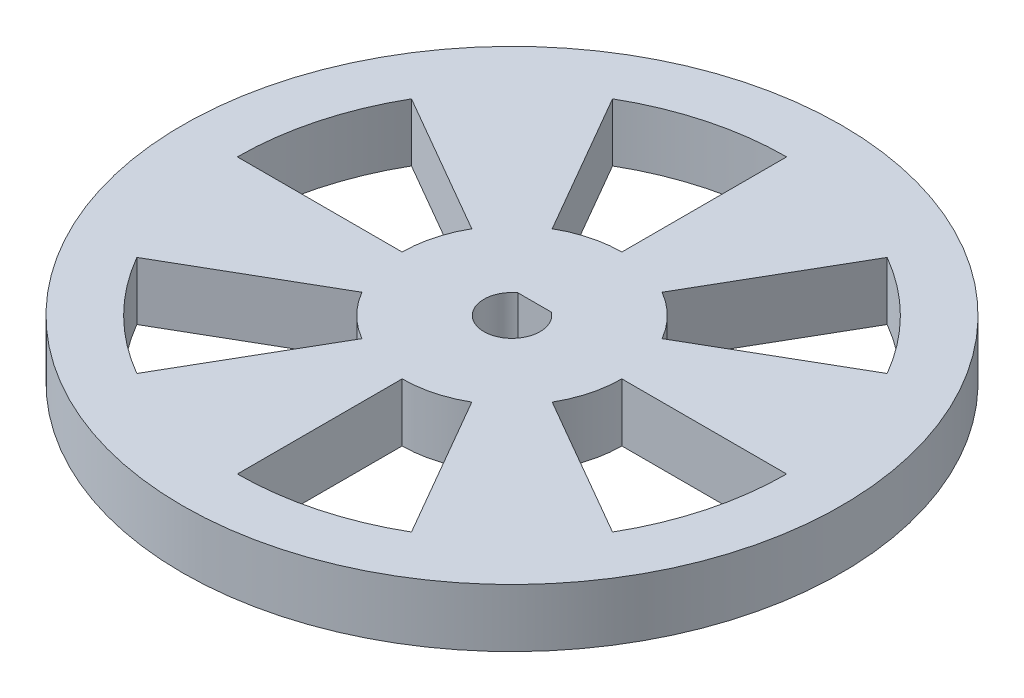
ISO-10303-21;
HEADER;
FILE_DESCRIPTION(('STEP AP214'),'2;1');
FILE_NAME('part.step','',(''),(''),'','','');
FILE_SCHEMA(('AUTOMOTIVE_DESIGN { 1 0 10303 214 1 1 1 1 }'));
ENDSEC;
DATA;
#1=APPLICATION_CONTEXT('core data for automotive mechanical design processes');
#2=APPLICATION_PROTOCOL_DEFINITION('international standard','automotive_design',2000,#1);
#3=PRODUCT_CONTEXT('',#1,'mechanical');
#4=PRODUCT('Part','Part','',(#3));
#5=PRODUCT_RELATED_PRODUCT_CATEGORY('part','',(#4));
#6=PRODUCT_DEFINITION_FORMATION('','',#4);
#7=PRODUCT_DEFINITION_CONTEXT('part definition',#1,'design');
#8=PRODUCT_DEFINITION('design','',#6,#7);
#9=PRODUCT_DEFINITION_SHAPE('','',#8);
#10=(LENGTH_UNIT() NAMED_UNIT(*) SI_UNIT(.MILLI.,.METRE.));
#11=(NAMED_UNIT(*) PLANE_ANGLE_UNIT() SI_UNIT($,.RADIAN.));
#12=(NAMED_UNIT(*) SI_UNIT($,.STERADIAN.) SOLID_ANGLE_UNIT());
#13=UNCERTAINTY_MEASURE_WITH_UNIT(LENGTH_MEASURE(1.E-05),#10,'distance_accuracy_value','');
#14=(GEOMETRIC_REPRESENTATION_CONTEXT(3) GLOBAL_UNCERTAINTY_ASSIGNED_CONTEXT((#13)) GLOBAL_UNIT_ASSIGNED_CONTEXT((#10,
#11,#12)) REPRESENTATION_CONTEXT('',''));
#15=CARTESIAN_POINT('',(0.,0.,0.));
#16=DIRECTION('',(0.,0.,1.));
#17=DIRECTION('',(1.,0.,0.));
#18=AXIS2_PLACEMENT_3D('',#15,#16,#17);
#19=CARTESIAN_POINT('',(0.,6.35,0.));
#20=DIRECTION('',(0.,1.,0.));
#21=DIRECTION('',(0.,0.,1.));
#22=AXIS2_PLACEMENT_3D('',#19,#20,#21);
#23=PLANE('',#22);
#24=DIRECTION('',(-0.500000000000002,0.,0.866025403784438));
#25=VECTOR('',#24,1.);
#26=CARTESIAN_POINT('',(5.99999999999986,6.35,-10.3923048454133));
#27=LINE('',#26,#25);
#28=CARTESIAN_POINT('',(14.9999999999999,6.35,-25.9807621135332));
#29=VERTEX_POINT('',#28);
#30=CARTESIAN_POINT('',(5.99999999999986,6.35,-10.3923048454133));
#31=VERTEX_POINT('',#30);
#32=EDGE_CURVE('E242',#29,#31,#27,.T.);
#33=ORIENTED_EDGE('',*,*,#32,.F.);
#34=CARTESIAN_POINT('',(0.,6.35,0.));
#35=DIRECTION('',(0.,1.,0.));
#36=DIRECTION('',(0.,0.,1.));
#37=AXIS2_PLACEMENT_3D('',#34,#35,#36);
#38=CIRCLE('',#37,30.);
#39=CARTESIAN_POINT('',(25.9807621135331,6.35,-15.0000000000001));
#40=VERTEX_POINT('',#39);
#41=EDGE_CURVE('E240',#40,#29,#38,.T.);
#42=ORIENTED_EDGE('',*,*,#41,.F.);
#43=DIRECTION('',(0.86602540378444,0.,-0.499999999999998));
#44=VECTOR('',#43,1.);
#45=CARTESIAN_POINT('',(10.3923048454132,6.35,-6.00000000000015));
#46=LINE('',#45,#44);
#47=CARTESIAN_POINT('',(10.3923048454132,6.35,-6.00000000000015));
#48=VERTEX_POINT('',#47);
#49=EDGE_CURVE('E248',#48,#40,#46,.T.);
#50=ORIENTED_EDGE('',*,*,#49,.F.);
#51=CARTESIAN_POINT('',(0.,6.35,0.));
#52=DIRECTION('',(0.,-1.,0.));
#53=DIRECTION('',(0.,0.,1.));
#54=AXIS2_PLACEMENT_3D('',#51,#52,#53);
#55=CIRCLE('',#54,12.);
#56=EDGE_CURVE('E245',#31,#48,#55,.T.);
#57=ORIENTED_EDGE('',*,*,#56,.F.);
#58=EDGE_LOOP('',(#33,#42,#50,#57));
#59=FACE_BOUND('',#58,.T.);
#60=DIRECTION('',(-1.,0.,0.));
#61=VECTOR('',#60,1.);
#62=CARTESIAN_POINT('',(1.83187666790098,6.35,-2.46356));
#63=LINE('',#62,#61);
#64=CARTESIAN_POINT('',(1.83187666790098,6.35,-2.46356));
#65=VERTEX_POINT('',#64);
#66=CARTESIAN_POINT('',(-1.83187666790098,6.35,-2.46356));
#67=VERTEX_POINT('',#66);
#68=EDGE_CURVE('E305',#65,#67,#63,.T.);
#69=ORIENTED_EDGE('',*,*,#68,.F.);
#70=CARTESIAN_POINT('',(0.,6.35,0.));
#71=DIRECTION('',(0.,1.,0.));
#72=DIRECTION('',(0.,0.,1.));
#73=AXIS2_PLACEMENT_3D('',#70,#71,#72);
#74=CIRCLE('',#73,3.07);
#75=EDGE_CURVE('E302',#67,#65,#74,.T.);
#76=ORIENTED_EDGE('',*,*,#75,.F.);
#77=EDGE_LOOP('',(#69,#76));
#78=FACE_BOUND('',#77,.T.);
#79=DIRECTION('',(0.500000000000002,0.,0.866025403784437));
#80=VECTOR('',#79,1.);
#81=CARTESIAN_POINT('',(-5.99999999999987,6.35,-10.3923048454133));
#82=LINE('',#81,#80);
#83=CARTESIAN_POINT('',(-14.9999999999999,6.35,-25.9807621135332));
#84=VERTEX_POINT('',#83);
#85=CARTESIAN_POINT('',(-5.99999999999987,6.35,-10.3923048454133));
#86=VERTEX_POINT('',#85);
#87=EDGE_CURVE('E352',#84,#86,#82,.T.);
#88=ORIENTED_EDGE('',*,*,#87,.F.);
#89=CARTESIAN_POINT('',(0.,6.35,0.));
#90=DIRECTION('',(0.,1.,0.));
#91=DIRECTION('',(0.,0.,1.));
#92=AXIS2_PLACEMENT_3D('',#89,#90,#91);
#93=CIRCLE('',#92,30.);
#94=CARTESIAN_POINT('',(-1.2615376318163E-13,6.35,-30.));
#95=VERTEX_POINT('',#94);
#96=EDGE_CURVE('E350',#95,#84,#93,.T.);
#97=ORIENTED_EDGE('',*,*,#96,.F.);
#98=DIRECTION('',(0.,0.,-1.));
#99=VECTOR('',#98,1.);
#100=CARTESIAN_POINT('',(-1.66061953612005E-13,6.35,-12.));
#101=LINE('',#100,#99);
#102=CARTESIAN_POINT('',(-1.66061953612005E-13,6.35,-12.));
#103=VERTEX_POINT('',#102);
#104=EDGE_CURVE('E358',#103,#95,#101,.T.);
#105=ORIENTED_EDGE('',*,*,#104,.F.);
#106=CARTESIAN_POINT('',(0.,6.35,0.));
#107=DIRECTION('',(0.,-1.,0.));
#108=DIRECTION('',(0.,0.,1.));
#109=AXIS2_PLACEMENT_3D('',#106,#107,#108);
#110=CIRCLE('',#109,12.);
#111=EDGE_CURVE('E355',#86,#103,#110,.T.);
#112=ORIENTED_EDGE('',*,*,#111,.F.);
#113=EDGE_LOOP('',(#88,#97,#105,#112));
#114=FACE_BOUND('',#113,.T.);
#115=CARTESIAN_POINT('',(0.,6.35,0.));
#116=DIRECTION('',(0.,1.,0.));
#117=DIRECTION('',(0.,0.,1.));
#118=AXIS2_PLACEMENT_3D('',#115,#116,#117);
#119=CIRCLE('',#118,36.);
#120=CARTESIAN_POINT('',(0.,6.35,36.));
#121=VERTEX_POINT('',#120);
#122=EDGE_CURVE('E11',#121,#121,#119,.T.);
#123=ORIENTED_EDGE('',*,*,#122,.T.);
#124=EDGE_LOOP('',(#123));
#125=FACE_BOUND('',#124,.T.);
#126=DIRECTION('',(-0.86602540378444,0.,0.499999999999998));
#127=VECTOR('',#126,1.);
#128=CARTESIAN_POINT('',(-10.3923048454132,6.35,6.00000000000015));
#129=LINE('',#128,#127);
#130=CARTESIAN_POINT('',(-10.3923048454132,6.35,6.00000000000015));
#131=VERTEX_POINT('',#130);
#132=CARTESIAN_POINT('',(-25.9807621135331,6.35,15.0000000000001));
#133=VERTEX_POINT('',#132);
#134=EDGE_CURVE('E383',#131,#133,#129,.T.);
#135=ORIENTED_EDGE('',*,*,#134,.F.);
#136=CARTESIAN_POINT('',(0.,6.35,0.));
#137=DIRECTION('',(0.,-1.,0.));
#138=DIRECTION('',(0.,0.,1.));
#139=AXIS2_PLACEMENT_3D('',#136,#137,#138);
#140=CIRCLE('',#139,12.);
#141=CARTESIAN_POINT('',(-5.99999999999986,6.35,10.3923048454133));
#142=VERTEX_POINT('',#141);
#143=EDGE_CURVE('E381',#142,#131,#140,.T.);
#144=ORIENTED_EDGE('',*,*,#143,.F.);
#145=DIRECTION('',(0.500000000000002,0.,-0.866025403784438));
#146=VECTOR('',#145,1.);
#147=CARTESIAN_POINT('',(-5.99999999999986,6.35,10.3923048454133));
#148=LINE('',#147,#146);
#149=CARTESIAN_POINT('',(-14.9999999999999,6.35,25.9807621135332));
#150=VERTEX_POINT('',#149);
#151=EDGE_CURVE('E389',#150,#142,#148,.T.);
#152=ORIENTED_EDGE('',*,*,#151,.F.);
#153=CARTESIAN_POINT('',(0.,6.35,0.));
#154=DIRECTION('',(0.,1.,0.));
#155=DIRECTION('',(0.,0.,1.));
#156=AXIS2_PLACEMENT_3D('',#153,#154,#155);
#157=CIRCLE('',#156,30.);
#158=EDGE_CURVE('E386',#133,#150,#157,.T.);
#159=ORIENTED_EDGE('',*,*,#158,.F.);
#160=EDGE_LOOP('',(#135,#144,#152,#159));
#161=FACE_BOUND('',#160,.T.);
#162=DIRECTION('',(-0.500000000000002,0.,-0.866025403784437));
#163=VECTOR('',#162,1.);
#164=CARTESIAN_POINT('',(5.99999999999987,6.35,10.3923048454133));
#165=LINE('',#164,#163);
#166=CARTESIAN_POINT('',(14.9999999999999,6.35,25.9807621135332));
#167=VERTEX_POINT('',#166);
#168=CARTESIAN_POINT('',(5.99999999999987,6.35,10.3923048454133));
#169=VERTEX_POINT('',#168);
#170=EDGE_CURVE('E321',#167,#169,#165,.T.);
#171=ORIENTED_EDGE('',*,*,#170,.F.);
#172=CARTESIAN_POINT('',(0.,6.35,0.));
#173=DIRECTION('',(0.,1.,0.));
#174=DIRECTION('',(0.,0.,1.));
#175=AXIS2_PLACEMENT_3D('',#172,#173,#174);
#176=CIRCLE('',#175,30.);
#177=CARTESIAN_POINT('',(1.16228476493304E-13,6.35,30.));
#178=VERTEX_POINT('',#177);
#179=EDGE_CURVE('E319',#178,#167,#176,.T.);
#180=ORIENTED_EDGE('',*,*,#179,.F.);
#181=DIRECTION('',(0.,0.,1.));
#182=VECTOR('',#181,1.);
#183=CARTESIAN_POINT('',(1.55030399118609E-13,6.35,12.));
#184=LINE('',#183,#182);
#185=CARTESIAN_POINT('',(1.55030399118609E-13,6.35,12.));
#186=VERTEX_POINT('',#185);
#187=EDGE_CURVE('E327',#186,#178,#184,.T.);
#188=ORIENTED_EDGE('',*,*,#187,.F.);
#189=CARTESIAN_POINT('',(0.,6.35,0.));
#190=DIRECTION('',(0.,-1.,0.));
#191=DIRECTION('',(0.,0.,1.));
#192=AXIS2_PLACEMENT_3D('',#189,#190,#191);
#193=CIRCLE('',#192,12.);
#194=EDGE_CURVE('E324',#169,#186,#193,.T.);
#195=ORIENTED_EDGE('',*,*,#194,.F.);
#196=EDGE_LOOP('',(#171,#180,#188,#195));
#197=FACE_BOUND('',#196,.T.);
#198=DIRECTION('',(1.,0.,0.));
#199=VECTOR('',#198,1.);
#200=CARTESIAN_POINT('',(-12.,6.35,-1.51746498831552E-13));
#201=LINE('',#200,#199);
#202=CARTESIAN_POINT('',(-30.,6.35,-1.04808720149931E-13));
#203=VERTEX_POINT('',#202);
#204=CARTESIAN_POINT('',(-12.,6.35,-1.51418265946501E-13));
#205=VERTEX_POINT('',#204);
#206=EDGE_CURVE('E273',#203,#205,#201,.T.);
#207=ORIENTED_EDGE('',*,*,#206,.F.);
#208=CARTESIAN_POINT('',(0.,6.35,0.));
#209=DIRECTION('',(0.,1.,0.));
#210=DIRECTION('',(0.,0.,1.));
#211=AXIS2_PLACEMENT_3D('',#208,#209,#210);
#212=CIRCLE('',#211,30.);
#213=CARTESIAN_POINT('',(-25.9807621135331,6.35,-15.0000000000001));
#214=VERTEX_POINT('',#213);
#215=EDGE_CURVE('E271',#214,#203,#212,.T.);
#216=ORIENTED_EDGE('',*,*,#215,.F.);
#217=DIRECTION('',(-0.86602540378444,0.,-0.499999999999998));
#218=VECTOR('',#217,1.);
#219=CARTESIAN_POINT('',(-10.3923048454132,6.35,-6.00000000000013));
#220=LINE('',#219,#218);
#221=CARTESIAN_POINT('',(-10.3923048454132,6.35,-6.00000000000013));
#222=VERTEX_POINT('',#221);
#223=EDGE_CURVE('E279',#222,#214,#220,.T.);
#224=ORIENTED_EDGE('',*,*,#223,.F.);
#225=CARTESIAN_POINT('',(0.,6.35,0.));
#226=DIRECTION('',(0.,-1.,0.));
#227=DIRECTION('',(0.,0.,1.));
#228=AXIS2_PLACEMENT_3D('',#225,#226,#227);
#229=CIRCLE('',#228,12.);
#230=EDGE_CURVE('E276',#205,#222,#229,.T.);
#231=ORIENTED_EDGE('',*,*,#230,.F.);
#232=EDGE_LOOP('',(#207,#216,#224,#231));
#233=FACE_BOUND('',#232,.T.);
#234=DIRECTION('',(0.86602540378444,0.,0.499999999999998));
#235=VECTOR('',#234,1.);
#236=CARTESIAN_POINT('',(10.3923048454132,6.35,6.00000000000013));
#237=LINE('',#236,#235);
#238=CARTESIAN_POINT('',(10.3923048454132,6.35,6.00000000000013));
#239=VERTEX_POINT('',#238);
#240=CARTESIAN_POINT('',(25.9807621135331,6.35,15.0000000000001));
#241=VERTEX_POINT('',#240);
#242=EDGE_CURVE('E212',#239,#241,#237,.T.);
#243=ORIENTED_EDGE('',*,*,#242,.F.);
#244=CARTESIAN_POINT('',(0.,6.35,0.));
#245=DIRECTION('',(0.,-1.,0.));
#246=DIRECTION('',(0.,0.,1.));
#247=AXIS2_PLACEMENT_3D('',#244,#245,#246);
#248=CIRCLE('',#247,12.);
#249=CARTESIAN_POINT('',(12.,6.35,1.55168499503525E-13));
#250=VERTEX_POINT('',#249);
#251=EDGE_CURVE('E204',#250,#239,#248,.T.);
#252=ORIENTED_EDGE('',*,*,#251,.F.);
#253=DIRECTION('',(-1.,0.,0.));
#254=VECTOR('',#253,1.);
#255=CARTESIAN_POINT('',(12.,6.35,1.55168499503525E-13));
#256=LINE('',#255,#254);
#257=CARTESIAN_POINT('',(30.,6.35,1.08394450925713E-13));
#258=VERTEX_POINT('',#257);
#259=EDGE_CURVE('E226',#258,#250,#256,.T.);
#260=ORIENTED_EDGE('',*,*,#259,.F.);
#261=CARTESIAN_POINT('',(0.,6.35,0.));
#262=DIRECTION('',(0.,1.,0.));
#263=DIRECTION('',(0.,0.,1.));
#264=AXIS2_PLACEMENT_3D('',#261,#262,#263);
#265=CIRCLE('',#264,30.);
#266=EDGE_CURVE('E224',#241,#258,#265,.T.);
#267=ORIENTED_EDGE('',*,*,#266,.F.);
#268=EDGE_LOOP('',(#243,#252,#260,#267));
#269=FACE_BOUND('',#268,.T.);
#270=ADVANCED_FACE('F31',(#59,#78,#114,#125,#161,#197,#233,#269),#23,.T.);
#271=CARTESIAN_POINT('',(0.,0.,0.));
#272=DIRECTION('',(0.,1.,0.));
#273=DIRECTION('',(0.,0.,1.));
#274=AXIS2_PLACEMENT_3D('',#271,#272,#273);
#275=PLANE('',#274);
#276=CARTESIAN_POINT('',(0.,0.,0.));
#277=DIRECTION('',(0.,1.,0.));
#278=DIRECTION('',(0.,0.,1.));
#279=AXIS2_PLACEMENT_3D('',#276,#277,#278);
#280=CIRCLE('',#279,30.);
#281=CARTESIAN_POINT('',(25.9807621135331,0.,-15.0000000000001));
#282=VERTEX_POINT('',#281);
#283=CARTESIAN_POINT('',(14.9999999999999,0.,-25.9807621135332));
#284=VERTEX_POINT('',#283);
#285=EDGE_CURVE('E220',#282,#284,#280,.T.);
#286=ORIENTED_EDGE('',*,*,#285,.T.);
#287=DIRECTION('',(-0.500000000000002,0.,0.866025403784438));
#288=VECTOR('',#287,1.);
#289=CARTESIAN_POINT('',(5.99999999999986,0.,-10.3923048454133));
#290=LINE('',#289,#288);
#291=CARTESIAN_POINT('',(5.99999999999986,0.,-10.3923048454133));
#292=VERTEX_POINT('',#291);
#293=EDGE_CURVE('E253',#284,#292,#290,.T.);
#294=ORIENTED_EDGE('',*,*,#293,.T.);
#295=CARTESIAN_POINT('',(0.,0.,0.));
#296=DIRECTION('',(0.,-1.,0.));
#297=DIRECTION('',(0.,0.,1.));
#298=AXIS2_PLACEMENT_3D('',#295,#296,#297);
#299=CIRCLE('',#298,12.);
#300=CARTESIAN_POINT('',(10.3923048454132,0.,-6.00000000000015));
#301=VERTEX_POINT('',#300);
#302=EDGE_CURVE('E256',#292,#301,#299,.T.);
#303=ORIENTED_EDGE('',*,*,#302,.T.);
#304=DIRECTION('',(0.86602540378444,0.,-0.499999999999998));
#305=VECTOR('',#304,1.);
#306=CARTESIAN_POINT('',(10.3923048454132,0.,-6.00000000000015));
#307=LINE('',#306,#305);
#308=EDGE_CURVE('E243',#301,#282,#307,.T.);
#309=ORIENTED_EDGE('',*,*,#308,.T.);
#310=EDGE_LOOP('',(#286,#294,#303,#309));
#311=FACE_BOUND('',#310,.T.);
#312=CARTESIAN_POINT('',(0.,0.,0.));
#313=DIRECTION('',(0.,1.,0.));
#314=DIRECTION('',(0.,0.,1.));
#315=AXIS2_PLACEMENT_3D('',#312,#313,#314);
#316=CIRCLE('',#315,3.07);
#317=CARTESIAN_POINT('',(-1.83187666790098,0.,-2.46356));
#318=VERTEX_POINT('',#317);
#319=CARTESIAN_POINT('',(1.83187666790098,0.,-2.46356));
#320=VERTEX_POINT('',#319);
#321=EDGE_CURVE('E301',#318,#320,#316,.T.);
#322=ORIENTED_EDGE('',*,*,#321,.T.);
#323=DIRECTION('',(-1.,0.,0.));
#324=VECTOR('',#323,1.);
#325=CARTESIAN_POINT('',(1.83187666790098,0.,-2.46356));
#326=LINE('',#325,#324);
#327=EDGE_CURVE('E306',#320,#318,#326,.T.);
#328=ORIENTED_EDGE('',*,*,#327,.T.);
#329=EDGE_LOOP('',(#322,#328));
#330=FACE_BOUND('',#329,.T.);
#331=CARTESIAN_POINT('',(0.,0.,0.));
#332=DIRECTION('',(0.,1.,0.));
#333=DIRECTION('',(0.,0.,1.));
#334=AXIS2_PLACEMENT_3D('',#331,#332,#333);
#335=CIRCLE('',#334,30.);
#336=CARTESIAN_POINT('',(-1.2615376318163E-13,0.,-30.));
#337=VERTEX_POINT('',#336);
#338=CARTESIAN_POINT('',(-14.9999999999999,0.,-25.9807621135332));
#339=VERTEX_POINT('',#338);
#340=EDGE_CURVE('E349',#337,#339,#335,.T.);
#341=ORIENTED_EDGE('',*,*,#340,.T.);
#342=DIRECTION('',(0.500000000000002,0.,0.866025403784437));
#343=VECTOR('',#342,1.);
#344=CARTESIAN_POINT('',(-5.99999999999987,0.,-10.3923048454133));
#345=LINE('',#344,#343);
#346=CARTESIAN_POINT('',(-5.99999999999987,0.,-10.3923048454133));
#347=VERTEX_POINT('',#346);
#348=EDGE_CURVE('E363',#339,#347,#345,.T.);
#349=ORIENTED_EDGE('',*,*,#348,.T.);
#350=CARTESIAN_POINT('',(0.,0.,0.));
#351=DIRECTION('',(0.,-1.,0.));
#352=DIRECTION('',(0.,0.,1.));
#353=AXIS2_PLACEMENT_3D('',#350,#351,#352);
#354=CIRCLE('',#353,12.);
#355=CARTESIAN_POINT('',(-1.63731658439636E-13,0.,-12.));
#356=VERTEX_POINT('',#355);
#357=EDGE_CURVE('E366',#347,#356,#354,.T.);
#358=ORIENTED_EDGE('',*,*,#357,.T.);
#359=DIRECTION('',(0.,0.,-1.));
#360=VECTOR('',#359,1.);
#361=CARTESIAN_POINT('',(-1.66061953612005E-13,0.,-12.));
#362=LINE('',#361,#360);
#363=EDGE_CURVE('E353',#356,#337,#362,.T.);
#364=ORIENTED_EDGE('',*,*,#363,.T.);
#365=EDGE_LOOP('',(#341,#349,#358,#364));
#366=FACE_BOUND('',#365,.T.);
#367=CARTESIAN_POINT('',(0.,0.,0.));
#368=DIRECTION('',(0.,1.,0.));
#369=DIRECTION('',(0.,0.,1.));
#370=AXIS2_PLACEMENT_3D('',#367,#368,#369);
#371=CIRCLE('',#370,36.);
#372=CARTESIAN_POINT('',(0.,0.,36.));
#373=VERTEX_POINT('',#372);
#374=EDGE_CURVE('E35',#373,#373,#371,.T.);
#375=ORIENTED_EDGE('',*,*,#374,.F.);
#376=EDGE_LOOP('',(#375));
#377=FACE_BOUND('',#376,.T.);
#378=CARTESIAN_POINT('',(0.,0.,0.));
#379=DIRECTION('',(0.,-1.,0.));
#380=DIRECTION('',(0.,0.,1.));
#381=AXIS2_PLACEMENT_3D('',#378,#379,#380);
#382=CIRCLE('',#381,12.);
#383=CARTESIAN_POINT('',(-5.99999999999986,0.,10.3923048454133));
#384=VERTEX_POINT('',#383);
#385=CARTESIAN_POINT('',(-10.3923048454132,0.,6.00000000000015));
#386=VERTEX_POINT('',#385);
#387=EDGE_CURVE('E380',#384,#386,#382,.T.);
#388=ORIENTED_EDGE('',*,*,#387,.T.);
#389=DIRECTION('',(-0.86602540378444,0.,0.499999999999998));
#390=VECTOR('',#389,1.);
#391=CARTESIAN_POINT('',(-10.3923048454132,0.,6.00000000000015));
#392=LINE('',#391,#390);
#393=CARTESIAN_POINT('',(-25.9807621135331,0.,15.0000000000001));
#394=VERTEX_POINT('',#393);
#395=EDGE_CURVE('E394',#386,#394,#392,.T.);
#396=ORIENTED_EDGE('',*,*,#395,.T.);
#397=CARTESIAN_POINT('',(0.,0.,0.));
#398=DIRECTION('',(0.,1.,0.));
#399=DIRECTION('',(0.,0.,1.));
#400=AXIS2_PLACEMENT_3D('',#397,#398,#399);
#401=CIRCLE('',#400,30.);
#402=CARTESIAN_POINT('',(-14.9999999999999,0.,25.9807621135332));
#403=VERTEX_POINT('',#402);
#404=EDGE_CURVE('E397',#394,#403,#401,.T.);
#405=ORIENTED_EDGE('',*,*,#404,.T.);
#406=DIRECTION('',(0.500000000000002,0.,-0.866025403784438));
#407=VECTOR('',#406,1.);
#408=CARTESIAN_POINT('',(-5.99999999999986,0.,10.3923048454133));
#409=LINE('',#408,#407);
#410=EDGE_CURVE('E384',#403,#384,#409,.T.);
#411=ORIENTED_EDGE('',*,*,#410,.T.);
#412=EDGE_LOOP('',(#388,#396,#405,#411));
#413=FACE_BOUND('',#412,.T.);
#414=CARTESIAN_POINT('',(0.,0.,0.));
#415=DIRECTION('',(0.,1.,0.));
#416=DIRECTION('',(0.,0.,1.));
#417=AXIS2_PLACEMENT_3D('',#414,#415,#416);
#418=CIRCLE('',#417,30.);
#419=CARTESIAN_POINT('',(1.16228476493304E-13,0.,30.));
#420=VERTEX_POINT('',#419);
#421=CARTESIAN_POINT('',(14.9999999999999,0.,25.9807621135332));
#422=VERTEX_POINT('',#421);
#423=EDGE_CURVE('E318',#420,#422,#418,.T.);
#424=ORIENTED_EDGE('',*,*,#423,.T.);
#425=DIRECTION('',(-0.500000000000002,0.,-0.866025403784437));
#426=VECTOR('',#425,1.);
#427=CARTESIAN_POINT('',(5.99999999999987,0.,10.3923048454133));
#428=LINE('',#427,#426);
#429=CARTESIAN_POINT('',(5.99999999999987,0.,10.3923048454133));
#430=VERTEX_POINT('',#429);
#431=EDGE_CURVE('E332',#422,#430,#428,.T.);
#432=ORIENTED_EDGE('',*,*,#431,.T.);
#433=CARTESIAN_POINT('',(0.,0.,0.));
#434=DIRECTION('',(0.,-1.,0.));
#435=DIRECTION('',(0.,0.,1.));
#436=AXIS2_PLACEMENT_3D('',#433,#434,#435);
#437=CIRCLE('',#436,12.);
#438=CARTESIAN_POINT('',(1.55030399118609E-13,0.,12.));
#439=VERTEX_POINT('',#438);
#440=EDGE_CURVE('E335',#430,#439,#437,.T.);
#441=ORIENTED_EDGE('',*,*,#440,.T.);
#442=DIRECTION('',(0.,0.,1.));
#443=VECTOR('',#442,1.);
#444=CARTESIAN_POINT('',(1.55030399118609E-13,0.,12.));
#445=LINE('',#444,#443);
#446=EDGE_CURVE('E322',#439,#420,#445,.T.);
#447=ORIENTED_EDGE('',*,*,#446,.T.);
#448=EDGE_LOOP('',(#424,#432,#441,#447));
#449=FACE_BOUND('',#448,.T.);
#450=CARTESIAN_POINT('',(0.,0.,0.));
#451=DIRECTION('',(0.,1.,0.));
#452=DIRECTION('',(0.,0.,1.));
#453=AXIS2_PLACEMENT_3D('',#450,#451,#452);
#454=CIRCLE('',#453,30.);
#455=CARTESIAN_POINT('',(-25.9807621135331,0.,-15.0000000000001));
#456=VERTEX_POINT('',#455);
#457=CARTESIAN_POINT('',(-30.,0.,-1.04808720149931E-13));
#458=VERTEX_POINT('',#457);
#459=EDGE_CURVE('E270',#456,#458,#454,.T.);
#460=ORIENTED_EDGE('',*,*,#459,.T.);
#461=DIRECTION('',(1.,0.,0.));
#462=VECTOR('',#461,1.);
#463=CARTESIAN_POINT('',(-12.,0.,-1.51746498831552E-13));
#464=LINE('',#463,#462);
#465=CARTESIAN_POINT('',(-12.,0.,-1.51418265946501E-13));
#466=VERTEX_POINT('',#465);
#467=EDGE_CURVE('E284',#458,#466,#464,.T.);
#468=ORIENTED_EDGE('',*,*,#467,.T.);
#469=CARTESIAN_POINT('',(0.,0.,0.));
#470=DIRECTION('',(0.,-1.,0.));
#471=DIRECTION('',(0.,0.,1.));
#472=AXIS2_PLACEMENT_3D('',#469,#470,#471);
#473=CIRCLE('',#472,12.);
#474=CARTESIAN_POINT('',(-10.3923048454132,0.,-6.00000000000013));
#475=VERTEX_POINT('',#474);
#476=EDGE_CURVE('E287',#466,#475,#473,.T.);
#477=ORIENTED_EDGE('',*,*,#476,.T.);
#478=DIRECTION('',(-0.86602540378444,0.,-0.499999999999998));
#479=VECTOR('',#478,1.);
#480=CARTESIAN_POINT('',(-10.3923048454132,0.,-6.00000000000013));
#481=LINE('',#480,#479);
#482=EDGE_CURVE('E274',#475,#456,#481,.T.);
#483=ORIENTED_EDGE('',*,*,#482,.T.);
#484=EDGE_LOOP('',(#460,#468,#477,#483));
#485=FACE_BOUND('',#484,.T.);
#486=CARTESIAN_POINT('',(0.,0.,0.));
#487=DIRECTION('',(0.,-1.,0.));
#488=DIRECTION('',(0.,0.,1.));
#489=AXIS2_PLACEMENT_3D('',#486,#487,#488);
#490=CIRCLE('',#489,12.);
#491=CARTESIAN_POINT('',(12.,0.,1.55168499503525E-13));
#492=VERTEX_POINT('',#491);
#493=CARTESIAN_POINT('',(10.3923048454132,0.,6.00000000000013));
#494=VERTEX_POINT('',#493);
#495=EDGE_CURVE('E54',#492,#494,#490,.T.);
#496=ORIENTED_EDGE('',*,*,#495,.T.);
#497=DIRECTION('',(0.86602540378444,0.,0.499999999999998));
#498=VECTOR('',#497,1.);
#499=CARTESIAN_POINT('',(10.3923048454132,0.,6.00000000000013));
#500=LINE('',#499,#498);
#501=CARTESIAN_POINT('',(25.9807621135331,0.,15.0000000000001));
#502=VERTEX_POINT('',#501);
#503=EDGE_CURVE('E219',#494,#502,#500,.T.);
#504=ORIENTED_EDGE('',*,*,#503,.T.);
#505=CARTESIAN_POINT('',(0.,0.,0.));
#506=DIRECTION('',(0.,1.,0.));
#507=DIRECTION('',(0.,0.,1.));
#508=AXIS2_PLACEMENT_3D('',#505,#506,#507);
#509=CIRCLE('',#508,30.);
#510=CARTESIAN_POINT('',(30.,0.,1.08394450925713E-13));
#511=VERTEX_POINT('',#510);
#512=EDGE_CURVE('E232',#502,#511,#509,.T.);
#513=ORIENTED_EDGE('',*,*,#512,.T.);
#514=DIRECTION('',(-1.,0.,0.));
#515=VECTOR('',#514,1.);
#516=CARTESIAN_POINT('',(12.,0.,1.55168499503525E-13));
#517=LINE('',#516,#515);
#518=EDGE_CURVE('E213',#511,#492,#517,.T.);
#519=ORIENTED_EDGE('',*,*,#518,.T.);
#520=EDGE_LOOP('',(#496,#504,#513,#519));
#521=FACE_BOUND('',#520,.T.);
#522=ADVANCED_FACE('F416',(#311,#330,#366,#377,#413,#449,#485,#521),#275,.F.);
#523=CARTESIAN_POINT('',(0.,6.35,0.));
#524=DIRECTION('',(0.,-1.,0.));
#525=DIRECTION('',(0.,0.,-1.));
#526=AXIS2_PLACEMENT_3D('',#523,#524,#525);
#527=CYLINDRICAL_SURFACE('',#526,36.);
#528=ORIENTED_EDGE('',*,*,#122,.F.);
#529=EDGE_LOOP('',(#528));
#530=FACE_BOUND('',#529,.T.);
#531=ORIENTED_EDGE('',*,*,#374,.T.);
#532=EDGE_LOOP('',(#531));
#533=FACE_BOUND('',#532,.T.);
#534=ADVANCED_FACE('F33',(#530,#533),#527,.T.);
#535=CARTESIAN_POINT('',(0.,6.35,0.));
#536=DIRECTION('',(0.,-1.,0.));
#537=DIRECTION('',(0.,0.,-1.));
#538=AXIS2_PLACEMENT_3D('',#535,#536,#537);
#539=CYLINDRICAL_SURFACE('',#538,12.);
#540=ORIENTED_EDGE('',*,*,#387,.F.);
#541=DIRECTION('',(0.,-1.,0.));
#542=VECTOR('',#541,1.);
#543=CARTESIAN_POINT('',(-5.99999999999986,6.35,10.3923048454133));
#544=LINE('',#543,#542);
#545=EDGE_CURVE('E391',#142,#384,#544,.T.);
#546=ORIENTED_EDGE('',*,*,#545,.F.);
#547=ORIENTED_EDGE('',*,*,#143,.T.);
#548=DIRECTION('',(0.,-1.,0.));
#549=VECTOR('',#548,1.);
#550=CARTESIAN_POINT('',(-10.3923048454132,6.35,6.00000000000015));
#551=LINE('',#550,#549);
#552=EDGE_CURVE('E408',#131,#386,#551,.T.);
#553=ORIENTED_EDGE('',*,*,#552,.T.);
#554=EDGE_LOOP('',(#540,#546,#547,#553));
#555=FACE_BOUND('',#554,.T.);
#556=ADVANCED_FACE('F441',(#555),#539,.T.);
#557=CARTESIAN_POINT('',(-10.3923048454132,6.35,6.00000000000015));
#558=DIRECTION('',(0.499999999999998,0.,0.86602540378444));
#559=DIRECTION('',(0.86602540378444,0.,-0.499999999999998));
#560=AXIS2_PLACEMENT_3D('',#557,#558,#559);
#561=PLANE('',#560);
#562=ORIENTED_EDGE('',*,*,#395,.F.);
#563=ORIENTED_EDGE('',*,*,#552,.F.);
#564=ORIENTED_EDGE('',*,*,#134,.T.);
#565=DIRECTION('',(0.,-1.,0.));
#566=VECTOR('',#565,1.);
#567=CARTESIAN_POINT('',(-25.9807621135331,6.35,15.0000000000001));
#568=LINE('',#567,#566);
#569=EDGE_CURVE('E406',#133,#394,#568,.T.);
#570=ORIENTED_EDGE('',*,*,#569,.T.);
#571=EDGE_LOOP('',(#562,#563,#564,#570));
#572=FACE_BOUND('',#571,.T.);
#573=ADVANCED_FACE('F444',(#572),#561,.T.);
#574=CARTESIAN_POINT('',(0.,6.35,0.));
#575=DIRECTION('',(0.,-1.,0.));
#576=DIRECTION('',(0.,0.,-1.));
#577=AXIS2_PLACEMENT_3D('',#574,#575,#576);
#578=CYLINDRICAL_SURFACE('',#577,30.);
#579=ORIENTED_EDGE('',*,*,#404,.F.);
#580=ORIENTED_EDGE('',*,*,#569,.F.);
#581=ORIENTED_EDGE('',*,*,#158,.T.);
#582=DIRECTION('',(0.,-1.,0.));
#583=VECTOR('',#582,1.);
#584=CARTESIAN_POINT('',(-14.9999999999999,6.35,25.9807621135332));
#585=LINE('',#584,#583);
#586=EDGE_CURVE('E404',#150,#403,#585,.T.);
#587=ORIENTED_EDGE('',*,*,#586,.T.);
#588=EDGE_LOOP('',(#579,#580,#581,#587));
#589=FACE_BOUND('',#588,.T.);
#590=ADVANCED_FACE('F447',(#589),#578,.F.);
#591=CARTESIAN_POINT('',(-5.99999999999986,6.35,10.3923048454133));
#592=DIRECTION('',(-0.866025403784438,0.,-0.500000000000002));
#593=DIRECTION('',(-0.500000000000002,0.,0.866025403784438));
#594=AXIS2_PLACEMENT_3D('',#591,#592,#593);
#595=PLANE('',#594);
#596=ORIENTED_EDGE('',*,*,#410,.F.);
#597=ORIENTED_EDGE('',*,*,#586,.F.);
#598=ORIENTED_EDGE('',*,*,#151,.T.);
#599=ORIENTED_EDGE('',*,*,#545,.T.);
#600=EDGE_LOOP('',(#596,#597,#598,#599));
#601=FACE_BOUND('',#600,.T.);
#602=ADVANCED_FACE('F451',(#601),#595,.T.);
#603=CARTESIAN_POINT('',(0.,6.35,0.));
#604=DIRECTION('',(0.,-1.,0.));
#605=DIRECTION('',(0.,0.,-1.));
#606=AXIS2_PLACEMENT_3D('',#603,#604,#605);
#607=CYLINDRICAL_SURFACE('',#606,30.);
#608=ORIENTED_EDGE('',*,*,#340,.F.);
#609=DIRECTION('',(0.,-1.,0.));
#610=VECTOR('',#609,1.);
#611=CARTESIAN_POINT('',(-1.2615376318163E-13,6.35,-30.));
#612=LINE('',#611,#610);
#613=EDGE_CURVE('E360',#95,#337,#612,.T.);
#614=ORIENTED_EDGE('',*,*,#613,.F.);
#615=ORIENTED_EDGE('',*,*,#96,.T.);
#616=DIRECTION('',(0.,-1.,0.));
#617=VECTOR('',#616,1.);
#618=CARTESIAN_POINT('',(-14.9999999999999,6.35,-25.9807621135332));
#619=LINE('',#618,#617);
#620=EDGE_CURVE('E377',#84,#339,#619,.T.);
#621=ORIENTED_EDGE('',*,*,#620,.T.);
#622=EDGE_LOOP('',(#608,#614,#615,#621));
#623=FACE_BOUND('',#622,.T.);
#624=ADVANCED_FACE('F455',(#623),#607,.F.);
#625=CARTESIAN_POINT('',(-5.99999999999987,6.35,-10.3923048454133));
#626=DIRECTION('',(0.866025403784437,0.,-0.500000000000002));
#627=DIRECTION('',(-0.500000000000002,0.,-0.866025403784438));
#628=AXIS2_PLACEMENT_3D('',#625,#626,#627);
#629=PLANE('',#628);
#630=ORIENTED_EDGE('',*,*,#348,.F.);
#631=ORIENTED_EDGE('',*,*,#620,.F.);
#632=ORIENTED_EDGE('',*,*,#87,.T.);
#633=DIRECTION('',(0.,-1.,0.));
#634=VECTOR('',#633,1.);
#635=CARTESIAN_POINT('',(-5.99999999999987,6.35,-10.3923048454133));
#636=LINE('',#635,#634);
#637=EDGE_CURVE('E375',#86,#347,#636,.T.);
#638=ORIENTED_EDGE('',*,*,#637,.T.);
#639=EDGE_LOOP('',(#630,#631,#632,#638));
#640=FACE_BOUND('',#639,.T.);
#641=ADVANCED_FACE('F459',(#640),#629,.T.);
#642=CARTESIAN_POINT('',(0.,6.35,0.));
#643=DIRECTION('',(0.,-1.,0.));
#644=DIRECTION('',(0.,0.,-1.));
#645=AXIS2_PLACEMENT_3D('',#642,#643,#644);
#646=CYLINDRICAL_SURFACE('',#645,12.);
#647=ORIENTED_EDGE('',*,*,#357,.F.);
#648=ORIENTED_EDGE('',*,*,#637,.F.);
#649=ORIENTED_EDGE('',*,*,#111,.T.);
#650=DIRECTION('',(0.,-1.,0.));
#651=VECTOR('',#650,1.);
#652=CARTESIAN_POINT('',(-1.63731658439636E-13,6.35,-12.));
#653=LINE('',#652,#651);
#654=EDGE_CURVE('E373',#103,#356,#653,.T.);
#655=ORIENTED_EDGE('',*,*,#654,.T.);
#656=EDGE_LOOP('',(#647,#648,#649,#655));
#657=FACE_BOUND('',#656,.T.);
#658=ADVANCED_FACE('F463',(#657),#646,.T.);
#659=CARTESIAN_POINT('',(-1.66061953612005E-13,6.35,-12.));
#660=DIRECTION('',(-1.,0.,0.));
#661=DIRECTION('',(0.,0.,1.));
#662=AXIS2_PLACEMENT_3D('',#659,#660,#661);
#663=PLANE('',#662);
#664=ORIENTED_EDGE('',*,*,#363,.F.);
#665=ORIENTED_EDGE('',*,*,#654,.F.);
#666=ORIENTED_EDGE('',*,*,#104,.T.);
#667=ORIENTED_EDGE('',*,*,#613,.T.);
#668=EDGE_LOOP('',(#664,#665,#666,#667));
#669=FACE_BOUND('',#668,.T.);
#670=ADVANCED_FACE('F467',(#669),#663,.T.);
#671=CARTESIAN_POINT('',(0.,6.35,0.));
#672=DIRECTION('',(0.,-1.,0.));
#673=DIRECTION('',(0.,0.,-1.));
#674=AXIS2_PLACEMENT_3D('',#671,#672,#673);
#675=CYLINDRICAL_SURFACE('',#674,30.);
#676=ORIENTED_EDGE('',*,*,#423,.F.);
#677=DIRECTION('',(0.,-1.,0.));
#678=VECTOR('',#677,1.);
#679=CARTESIAN_POINT('',(1.16228476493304E-13,6.35,30.));
#680=LINE('',#679,#678);
#681=EDGE_CURVE('E329',#178,#420,#680,.T.);
#682=ORIENTED_EDGE('',*,*,#681,.F.);
#683=ORIENTED_EDGE('',*,*,#179,.T.);
#684=DIRECTION('',(0.,-1.,0.));
#685=VECTOR('',#684,1.);
#686=CARTESIAN_POINT('',(14.9999999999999,6.35,25.9807621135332));
#687=LINE('',#686,#685);
#688=EDGE_CURVE('E346',#167,#422,#687,.T.);
#689=ORIENTED_EDGE('',*,*,#688,.T.);
#690=EDGE_LOOP('',(#676,#682,#683,#689));
#691=FACE_BOUND('',#690,.T.);
#692=ADVANCED_FACE('F471',(#691),#675,.F.);
#693=CARTESIAN_POINT('',(5.99999999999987,6.35,10.3923048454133));
#694=DIRECTION('',(-0.866025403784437,0.,0.500000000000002));
#695=DIRECTION('',(0.500000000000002,0.,0.866025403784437));
#696=AXIS2_PLACEMENT_3D('',#693,#694,#695);
#697=PLANE('',#696);
#698=ORIENTED_EDGE('',*,*,#431,.F.);
#699=ORIENTED_EDGE('',*,*,#688,.F.);
#700=ORIENTED_EDGE('',*,*,#170,.T.);
#701=DIRECTION('',(0.,-1.,0.));
#702=VECTOR('',#701,1.);
#703=CARTESIAN_POINT('',(5.99999999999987,6.35,10.3923048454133));
#704=LINE('',#703,#702);
#705=EDGE_CURVE('E344',#169,#430,#704,.T.);
#706=ORIENTED_EDGE('',*,*,#705,.T.);
#707=EDGE_LOOP('',(#698,#699,#700,#706));
#708=FACE_BOUND('',#707,.T.);
#709=ADVANCED_FACE('F475',(#708),#697,.T.);
#710=CARTESIAN_POINT('',(0.,6.35,0.));
#711=DIRECTION('',(0.,-1.,0.));
#712=DIRECTION('',(0.,0.,-1.));
#713=AXIS2_PLACEMENT_3D('',#710,#711,#712);
#714=CYLINDRICAL_SURFACE('',#713,12.);
#715=ORIENTED_EDGE('',*,*,#440,.F.);
#716=ORIENTED_EDGE('',*,*,#705,.F.);
#717=ORIENTED_EDGE('',*,*,#194,.T.);
#718=DIRECTION('',(0.,-1.,0.));
#719=VECTOR('',#718,1.);
#720=CARTESIAN_POINT('',(1.55030399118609E-13,6.35,12.));
#721=LINE('',#720,#719);
#722=EDGE_CURVE('E342',#186,#439,#721,.T.);
#723=ORIENTED_EDGE('',*,*,#722,.T.);
#724=EDGE_LOOP('',(#715,#716,#717,#723));
#725=FACE_BOUND('',#724,.T.);
#726=ADVANCED_FACE('F479',(#725),#714,.T.);
#727=CARTESIAN_POINT('',(1.55030399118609E-13,6.35,12.));
#728=DIRECTION('',(1.,0.,0.));
#729=DIRECTION('',(0.,0.,-1.));
#730=AXIS2_PLACEMENT_3D('',#727,#728,#729);
#731=PLANE('',#730);
#732=ORIENTED_EDGE('',*,*,#446,.F.);
#733=ORIENTED_EDGE('',*,*,#722,.F.);
#734=ORIENTED_EDGE('',*,*,#187,.T.);
#735=ORIENTED_EDGE('',*,*,#681,.T.);
#736=EDGE_LOOP('',(#732,#733,#734,#735));
#737=FACE_BOUND('',#736,.T.);
#738=ADVANCED_FACE('F483',(#737),#731,.T.);
#739=CARTESIAN_POINT('',(0.,6.35,0.));
#740=DIRECTION('',(0.,-1.,0.));
#741=DIRECTION('',(0.,0.,-1.));
#742=AXIS2_PLACEMENT_3D('',#739,#740,#741);
#743=CYLINDRICAL_SURFACE('',#742,3.07);
#744=ORIENTED_EDGE('',*,*,#321,.F.);
#745=DIRECTION('',(0.,-1.,0.));
#746=VECTOR('',#745,1.);
#747=CARTESIAN_POINT('',(-1.83187666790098,6.35,-2.46356));
#748=LINE('',#747,#746);
#749=EDGE_CURVE('E308',#67,#318,#748,.T.);
#750=ORIENTED_EDGE('',*,*,#749,.F.);
#751=ORIENTED_EDGE('',*,*,#75,.T.);
#752=DIRECTION('',(0.,-1.,0.));
#753=VECTOR('',#752,1.);
#754=CARTESIAN_POINT('',(1.83187666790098,6.35,-2.46356));
#755=LINE('',#754,#753);
#756=EDGE_CURVE('E315',#65,#320,#755,.T.);
#757=ORIENTED_EDGE('',*,*,#756,.T.);
#758=EDGE_LOOP('',(#744,#750,#751,#757));
#759=FACE_BOUND('',#758,.T.);
#760=ADVANCED_FACE('F487',(#759),#743,.F.);
#761=CARTESIAN_POINT('',(1.83187666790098,6.35,-2.46356));
#762=DIRECTION('',(0.,0.,1.));
#763=DIRECTION('',(1.,0.,0.));
#764=AXIS2_PLACEMENT_3D('',#761,#762,#763);
#765=PLANE('',#764);
#766=ORIENTED_EDGE('',*,*,#327,.F.);
#767=ORIENTED_EDGE('',*,*,#756,.F.);
#768=ORIENTED_EDGE('',*,*,#68,.T.);
#769=ORIENTED_EDGE('',*,*,#749,.T.);
#770=EDGE_LOOP('',(#766,#767,#768,#769));
#771=FACE_BOUND('',#770,.T.);
#772=ADVANCED_FACE('F491',(#771),#765,.T.);
#773=CARTESIAN_POINT('',(0.,6.35,0.));
#774=DIRECTION('',(0.,-1.,0.));
#775=DIRECTION('',(0.,0.,-1.));
#776=AXIS2_PLACEMENT_3D('',#773,#774,#775);
#777=CYLINDRICAL_SURFACE('',#776,30.);
#778=ORIENTED_EDGE('',*,*,#459,.F.);
#779=DIRECTION('',(0.,-1.,0.));
#780=VECTOR('',#779,1.);
#781=CARTESIAN_POINT('',(-25.9807621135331,6.35,-15.0000000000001));
#782=LINE('',#781,#780);
#783=EDGE_CURVE('E281',#214,#456,#782,.T.);
#784=ORIENTED_EDGE('',*,*,#783,.F.);
#785=ORIENTED_EDGE('',*,*,#215,.T.);
#786=DIRECTION('',(0.,-1.,0.));
#787=VECTOR('',#786,1.);
#788=CARTESIAN_POINT('',(-30.,6.35,-1.04808720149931E-13));
#789=LINE('',#788,#787);
#790=EDGE_CURVE('E298',#203,#458,#789,.T.);
#791=ORIENTED_EDGE('',*,*,#790,.T.);
#792=EDGE_LOOP('',(#778,#784,#785,#791));
#793=FACE_BOUND('',#792,.T.);
#794=ADVANCED_FACE('F495',(#793),#777,.F.);
#795=CARTESIAN_POINT('',(-12.,6.35,-1.51746498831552E-13));
#796=DIRECTION('',(0.,0.,-1.));
#797=DIRECTION('',(-1.,0.,0.));
#798=AXIS2_PLACEMENT_3D('',#795,#796,#797);
#799=PLANE('',#798);
#800=ORIENTED_EDGE('',*,*,#467,.F.);
#801=ORIENTED_EDGE('',*,*,#790,.F.);
#802=ORIENTED_EDGE('',*,*,#206,.T.);
#803=DIRECTION('',(0.,-1.,0.));
#804=VECTOR('',#803,1.);
#805=CARTESIAN_POINT('',(-12.,6.35,-1.51418265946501E-13));
#806=LINE('',#805,#804);
#807=EDGE_CURVE('E296',#205,#466,#806,.T.);
#808=ORIENTED_EDGE('',*,*,#807,.T.);
#809=EDGE_LOOP('',(#800,#801,#802,#808));
#810=FACE_BOUND('',#809,.T.);
#811=ADVANCED_FACE('F499',(#810),#799,.T.);
#812=CARTESIAN_POINT('',(0.,6.35,0.));
#813=DIRECTION('',(0.,-1.,0.));
#814=DIRECTION('',(0.,0.,-1.));
#815=AXIS2_PLACEMENT_3D('',#812,#813,#814);
#816=CYLINDRICAL_SURFACE('',#815,12.);
#817=ORIENTED_EDGE('',*,*,#476,.F.);
#818=ORIENTED_EDGE('',*,*,#807,.F.);
#819=ORIENTED_EDGE('',*,*,#230,.T.);
#820=DIRECTION('',(0.,-1.,0.));
#821=VECTOR('',#820,1.);
#822=CARTESIAN_POINT('',(-10.3923048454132,6.35,-6.00000000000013));
#823=LINE('',#822,#821);
#824=EDGE_CURVE('E294',#222,#475,#823,.T.);
#825=ORIENTED_EDGE('',*,*,#824,.T.);
#826=EDGE_LOOP('',(#817,#818,#819,#825));
#827=FACE_BOUND('',#826,.T.);
#828=ADVANCED_FACE('F503',(#827),#816,.T.);
#829=CARTESIAN_POINT('',(-10.3923048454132,6.35,-6.00000000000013));
#830=DIRECTION('',(-0.499999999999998,0.,0.86602540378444));
#831=DIRECTION('',(0.86602540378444,0.,0.499999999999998));
#832=AXIS2_PLACEMENT_3D('',#829,#830,#831);
#833=PLANE('',#832);
#834=ORIENTED_EDGE('',*,*,#482,.F.);
#835=ORIENTED_EDGE('',*,*,#824,.F.);
#836=ORIENTED_EDGE('',*,*,#223,.T.);
#837=ORIENTED_EDGE('',*,*,#783,.T.);
#838=EDGE_LOOP('',(#834,#835,#836,#837));
#839=FACE_BOUND('',#838,.T.);
#840=ADVANCED_FACE('F507',(#839),#833,.T.);
#841=CARTESIAN_POINT('',(0.,6.35,0.));
#842=DIRECTION('',(0.,-1.,0.));
#843=DIRECTION('',(0.,0.,-1.));
#844=AXIS2_PLACEMENT_3D('',#841,#842,#843);
#845=CYLINDRICAL_SURFACE('',#844,30.);
#846=ORIENTED_EDGE('',*,*,#285,.F.);
#847=DIRECTION('',(0.,-1.,0.));
#848=VECTOR('',#847,1.);
#849=CARTESIAN_POINT('',(25.9807621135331,6.35,-15.0000000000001));
#850=LINE('',#849,#848);
#851=EDGE_CURVE('E250',#40,#282,#850,.T.);
#852=ORIENTED_EDGE('',*,*,#851,.F.);
#853=ORIENTED_EDGE('',*,*,#41,.T.);
#854=DIRECTION('',(0.,-1.,0.));
#855=VECTOR('',#854,1.);
#856=CARTESIAN_POINT('',(14.9999999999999,6.35,-25.9807621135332));
#857=LINE('',#856,#855);
#858=EDGE_CURVE('E267',#29,#284,#857,.T.);
#859=ORIENTED_EDGE('',*,*,#858,.T.);
#860=EDGE_LOOP('',(#846,#852,#853,#859));
#861=FACE_BOUND('',#860,.T.);
#862=ADVANCED_FACE('F511',(#861),#845,.F.);
#863=CARTESIAN_POINT('',(5.99999999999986,6.35,-10.3923048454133));
#864=DIRECTION('',(0.866025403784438,0.,0.500000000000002));
#865=DIRECTION('',(0.500000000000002,0.,-0.866025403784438));
#866=AXIS2_PLACEMENT_3D('',#863,#864,#865);
#867=PLANE('',#866);
#868=ORIENTED_EDGE('',*,*,#293,.F.);
#869=ORIENTED_EDGE('',*,*,#858,.F.);
#870=ORIENTED_EDGE('',*,*,#32,.T.);
#871=DIRECTION('',(0.,-1.,0.));
#872=VECTOR('',#871,1.);
#873=CARTESIAN_POINT('',(5.99999999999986,6.35,-10.3923048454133));
#874=LINE('',#873,#872);
#875=EDGE_CURVE('E265',#31,#292,#874,.T.);
#876=ORIENTED_EDGE('',*,*,#875,.T.);
#877=EDGE_LOOP('',(#868,#869,#870,#876));
#878=FACE_BOUND('',#877,.T.);
#879=ADVANCED_FACE('F515',(#878),#867,.T.);
#880=CARTESIAN_POINT('',(0.,6.35,0.));
#881=DIRECTION('',(0.,-1.,0.));
#882=DIRECTION('',(0.,0.,-1.));
#883=AXIS2_PLACEMENT_3D('',#880,#881,#882);
#884=CYLINDRICAL_SURFACE('',#883,12.);
#885=ORIENTED_EDGE('',*,*,#302,.F.);
#886=ORIENTED_EDGE('',*,*,#875,.F.);
#887=ORIENTED_EDGE('',*,*,#56,.T.);
#888=DIRECTION('',(0.,-1.,0.));
#889=VECTOR('',#888,1.);
#890=CARTESIAN_POINT('',(10.3923048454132,6.35,-6.00000000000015));
#891=LINE('',#890,#889);
#892=EDGE_CURVE('E263',#48,#301,#891,.T.);
#893=ORIENTED_EDGE('',*,*,#892,.T.);
#894=EDGE_LOOP('',(#885,#886,#887,#893));
#895=FACE_BOUND('',#894,.T.);
#896=ADVANCED_FACE('F519',(#895),#884,.T.);
#897=CARTESIAN_POINT('',(10.3923048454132,6.35,-6.00000000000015));
#898=DIRECTION('',(-0.499999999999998,0.,-0.86602540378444));
#899=DIRECTION('',(-0.86602540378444,0.,0.499999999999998));
#900=AXIS2_PLACEMENT_3D('',#897,#898,#899);
#901=PLANE('',#900);
#902=ORIENTED_EDGE('',*,*,#308,.F.);
#903=ORIENTED_EDGE('',*,*,#892,.F.);
#904=ORIENTED_EDGE('',*,*,#49,.T.);
#905=ORIENTED_EDGE('',*,*,#851,.T.);
#906=EDGE_LOOP('',(#902,#903,#904,#905));
#907=FACE_BOUND('',#906,.T.);
#908=ADVANCED_FACE('F523',(#907),#901,.T.);
#909=CARTESIAN_POINT('',(0.,6.35,0.));
#910=DIRECTION('',(0.,-1.,0.));
#911=DIRECTION('',(0.,0.,-1.));
#912=AXIS2_PLACEMENT_3D('',#909,#910,#911);
#913=CYLINDRICAL_SURFACE('',#912,12.);
#914=ORIENTED_EDGE('',*,*,#495,.F.);
#915=DIRECTION('',(0.,-1.,0.));
#916=VECTOR('',#915,1.);
#917=CARTESIAN_POINT('',(12.,6.35,1.55168499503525E-13));
#918=LINE('',#917,#916);
#919=EDGE_CURVE('E208',#250,#492,#918,.T.);
#920=ORIENTED_EDGE('',*,*,#919,.F.);
#921=ORIENTED_EDGE('',*,*,#251,.T.);
#922=DIRECTION('',(0.,-1.,0.));
#923=VECTOR('',#922,1.);
#924=CARTESIAN_POINT('',(10.3923048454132,6.35,6.00000000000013));
#925=LINE('',#924,#923);
#926=EDGE_CURVE('E207',#239,#494,#925,.T.);
#927=ORIENTED_EDGE('',*,*,#926,.T.);
#928=EDGE_LOOP('',(#914,#920,#921,#927));
#929=FACE_BOUND('',#928,.T.);
#930=ADVANCED_FACE('F206',(#929),#913,.T.);
#931=CARTESIAN_POINT('',(10.3923048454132,6.35,6.00000000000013));
#932=DIRECTION('',(0.499999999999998,0.,-0.86602540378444));
#933=DIRECTION('',(-0.86602540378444,0.,-0.499999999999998));
#934=AXIS2_PLACEMENT_3D('',#931,#932,#933);
#935=PLANE('',#934);
#936=ORIENTED_EDGE('',*,*,#503,.F.);
#937=ORIENTED_EDGE('',*,*,#926,.F.);
#938=ORIENTED_EDGE('',*,*,#242,.T.);
#939=DIRECTION('',(0.,-1.,0.));
#940=VECTOR('',#939,1.);
#941=CARTESIAN_POINT('',(25.9807621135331,6.35,15.0000000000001));
#942=LINE('',#941,#940);
#943=EDGE_CURVE('E221',#241,#502,#942,.T.);
#944=ORIENTED_EDGE('',*,*,#943,.T.);
#945=EDGE_LOOP('',(#936,#937,#938,#944));
#946=FACE_BOUND('',#945,.T.);
#947=ADVANCED_FACE('F216',(#946),#935,.T.);
#948=CARTESIAN_POINT('',(0.,6.35,0.));
#949=DIRECTION('',(0.,-1.,0.));
#950=DIRECTION('',(0.,0.,-1.));
#951=AXIS2_PLACEMENT_3D('',#948,#949,#950);
#952=CYLINDRICAL_SURFACE('',#951,30.);
#953=ORIENTED_EDGE('',*,*,#512,.F.);
#954=ORIENTED_EDGE('',*,*,#943,.F.);
#955=ORIENTED_EDGE('',*,*,#266,.T.);
#956=DIRECTION('',(0.,-1.,0.));
#957=VECTOR('',#956,1.);
#958=CARTESIAN_POINT('',(30.,6.35,1.08394450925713E-13));
#959=LINE('',#958,#957);
#960=EDGE_CURVE('E46',#258,#511,#959,.T.);
#961=ORIENTED_EDGE('',*,*,#960,.T.);
#962=EDGE_LOOP('',(#953,#954,#955,#961));
#963=FACE_BOUND('',#962,.T.);
#964=ADVANCED_FACE('F426',(#963),#952,.F.);
#965=CARTESIAN_POINT('',(12.,6.35,1.55168499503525E-13));
#966=DIRECTION('',(0.,0.,1.));
#967=DIRECTION('',(1.,0.,0.));
#968=AXIS2_PLACEMENT_3D('',#965,#966,#967);
#969=PLANE('',#968);
#970=ORIENTED_EDGE('',*,*,#518,.F.);
#971=ORIENTED_EDGE('',*,*,#960,.F.);
#972=ORIENTED_EDGE('',*,*,#259,.T.);
#973=ORIENTED_EDGE('',*,*,#919,.T.);
#974=EDGE_LOOP('',(#970,#971,#972,#973));
#975=FACE_BOUND('',#974,.T.);
#976=ADVANCED_FACE('F424',(#975),#969,.T.);
#977=CLOSED_SHELL('',(#270,#522,#534,#556,#573,#590,#602,#624,#641,#658,#670,#692,#709,#726,
#738,#760,#772,#794,#811,#828,#840,#862,#879,#896,#908,#930,#947,#964,#976));
#978=MANIFOLD_SOLID_BREP('B2',#977);
#979=ADVANCED_BREP_SHAPE_REPRESENTATION('',(#18,#978),#14);
#980=SHAPE_DEFINITION_REPRESENTATION(#9,#979);
ENDSEC;
END-ISO-10303-21;
